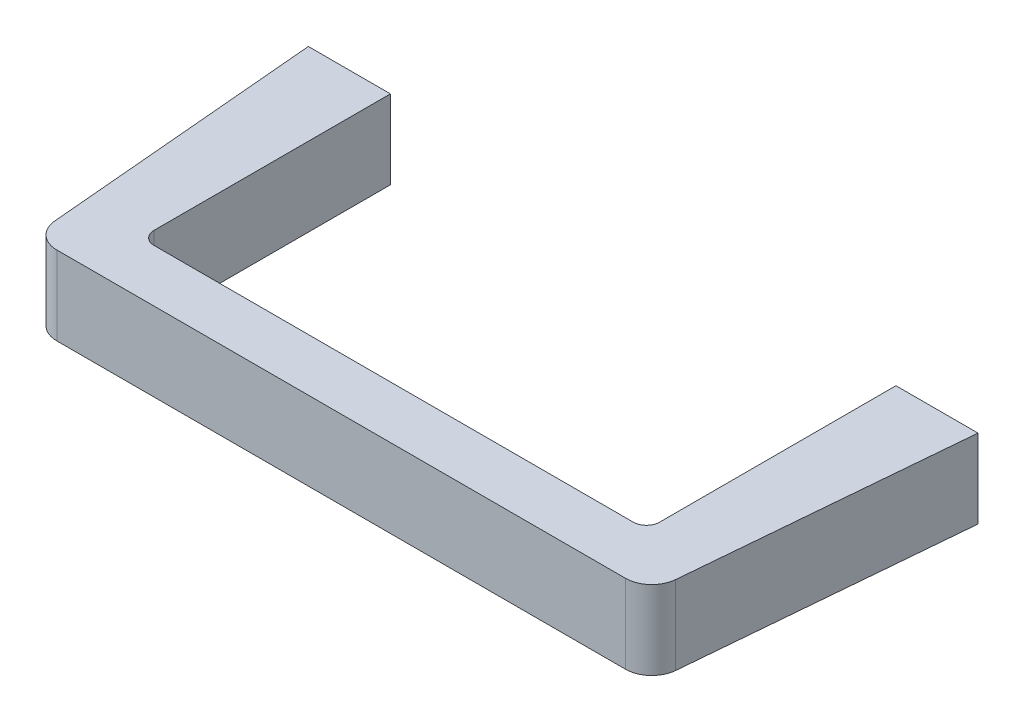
ISO-10303-21;
HEADER;
FILE_DESCRIPTION(('STEP AP214'),'2;1');
FILE_NAME('part.step','',(''),(''),'','','');
FILE_SCHEMA(('AUTOMOTIVE_DESIGN { 1 0 10303 214 1 1 1 1 }'));
ENDSEC;
DATA;
#1=APPLICATION_CONTEXT('core data for automotive mechanical design processes');
#2=APPLICATION_PROTOCOL_DEFINITION('international standard','automotive_design',2000,#1);
#3=PRODUCT_CONTEXT('',#1,'mechanical');
#4=PRODUCT('Part','Part','',(#3));
#5=PRODUCT_RELATED_PRODUCT_CATEGORY('part','',(#4));
#6=PRODUCT_DEFINITION_FORMATION('','',#4);
#7=PRODUCT_DEFINITION_CONTEXT('part definition',#1,'design');
#8=PRODUCT_DEFINITION('design','',#6,#7);
#9=PRODUCT_DEFINITION_SHAPE('','',#8);
#10=(LENGTH_UNIT() NAMED_UNIT(*) SI_UNIT(.MILLI.,.METRE.));
#11=(NAMED_UNIT(*) PLANE_ANGLE_UNIT() SI_UNIT($,.RADIAN.));
#12=(NAMED_UNIT(*) SI_UNIT($,.STERADIAN.) SOLID_ANGLE_UNIT());
#13=UNCERTAINTY_MEASURE_WITH_UNIT(LENGTH_MEASURE(1.E-05),#10,'distance_accuracy_value','');
#14=(GEOMETRIC_REPRESENTATION_CONTEXT(3) GLOBAL_UNCERTAINTY_ASSIGNED_CONTEXT((#13)) GLOBAL_UNIT_ASSIGNED_CONTEXT((#10,
#11,#12)) REPRESENTATION_CONTEXT('',''));
#15=CARTESIAN_POINT('',(0.,0.,0.));
#16=DIRECTION('',(0.,0.,1.));
#17=DIRECTION('',(1.,0.,0.));
#18=AXIS2_PLACEMENT_3D('',#15,#16,#17);
#19=CARTESIAN_POINT('',(5.5,-6.,0.));
#20=DIRECTION('',(0.,0.,-1.));
#21=DIRECTION('',(0.,1.,0.));
#22=AXIS2_PLACEMENT_3D('',#19,#20,#21);
#23=PLANE('',#22);
#24=DIRECTION('',(0.,1.,0.));
#25=VECTOR('',#24,1.);
#26=CARTESIAN_POINT('',(5.5,-6.,0.));
#27=LINE('',#26,#25);
#28=CARTESIAN_POINT('',(5.5,-6.,0.));
#29=VERTEX_POINT('',#28);
#30=CARTESIAN_POINT('',(5.5,6.,0.));
#31=VERTEX_POINT('',#30);
#32=EDGE_CURVE('E199',#29,#31,#27,.T.);
#33=ORIENTED_EDGE('',*,*,#32,.F.);
#34=DIRECTION('',(-1.,0.,0.));
#35=VECTOR('',#34,1.);
#36=CARTESIAN_POINT('',(5.5,-6.,0.));
#37=LINE('',#36,#35);
#38=CARTESIAN_POINT('',(-7.00000000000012,-6.,0.));
#39=VERTEX_POINT('',#38);
#40=EDGE_CURVE('E155',#29,#39,#37,.T.);
#41=ORIENTED_EDGE('',*,*,#40,.T.);
#42=DIRECTION('',(0.,1.,0.));
#43=VECTOR('',#42,1.);
#44=CARTESIAN_POINT('',(-7.00000000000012,-6.,0.));
#45=LINE('',#44,#43);
#46=CARTESIAN_POINT('',(-7.00000000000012,6.,0.));
#47=VERTEX_POINT('',#46);
#48=EDGE_CURVE('E22',#39,#47,#45,.T.);
#49=ORIENTED_EDGE('',*,*,#48,.T.);
#50=DIRECTION('',(-1.,0.,0.));
#51=VECTOR('',#50,1.);
#52=CARTESIAN_POINT('',(5.5,6.,0.));
#53=LINE('',#52,#51);
#54=EDGE_CURVE('E122',#31,#47,#53,.T.);
#55=ORIENTED_EDGE('',*,*,#54,.F.);
#56=EDGE_LOOP('',(#33,#41,#49,#55));
#57=FACE_BOUND('',#56,.T.);
#58=CARTESIAN_POINT('',(0.,0.,0.));
#59=DIRECTION('',(0.,0.,1.));
#60=DIRECTION('',(0.,-1.,0.));
#61=AXIS2_PLACEMENT_3D('',#58,#59,#60);
#62=CIRCLE('',#61,2.5);
#63=CARTESIAN_POINT('',(0.,-2.5,0.));
#64=VERTEX_POINT('',#63);
#65=EDGE_CURVE('E399',#64,#64,#62,.T.);
#66=ORIENTED_EDGE('',*,*,#65,.T.);
#67=EDGE_LOOP('',(#66));
#68=FACE_BOUND('',#67,.T.);
#69=ADVANCED_FACE('F14',(#57,#68),#23,.T.);
#70=CARTESIAN_POINT('',(0.689803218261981,-6.,42.));
#71=DIRECTION('',(0.,1.,0.));
#72=DIRECTION('',(-1.,0.,0.));
#73=AXIS2_PLACEMENT_3D('',#70,#71,#72);
#74=CYLINDRICAL_SURFACE('',#73,4.);
#75=DIRECTION('',(0.,1.,0.));
#76=VECTOR('',#75,1.);
#77=CARTESIAN_POINT('',(-3.29497557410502,-6.,42.3486229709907));
#78=LINE('',#77,#76);
#79=CARTESIAN_POINT('',(-3.29497557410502,-6.,42.3486229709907));
#80=VERTEX_POINT('',#79);
#81=CARTESIAN_POINT('',(-3.29497557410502,6.,42.3486229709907));
#82=VERTEX_POINT('',#81);
#83=EDGE_CURVE('E9',#80,#82,#78,.T.);
#84=ORIENTED_EDGE('',*,*,#83,.F.);
#85=CARTESIAN_POINT('',(0.689803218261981,-6.,42.));
#86=DIRECTION('',(0.,-1.,0.));
#87=DIRECTION('',(1.,0.,0.));
#88=AXIS2_PLACEMENT_3D('',#85,#86,#87);
#89=CIRCLE('',#88,4.);
#90=CARTESIAN_POINT('',(0.689803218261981,-6.,46.));
#91=VERTEX_POINT('',#90);
#92=EDGE_CURVE('E152',#91,#80,#89,.T.);
#93=ORIENTED_EDGE('',*,*,#92,.F.);
#94=DIRECTION('',(0.,1.,0.));
#95=VECTOR('',#94,1.);
#96=CARTESIAN_POINT('',(0.689803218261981,-6.,46.));
#97=LINE('',#96,#95);
#98=CARTESIAN_POINT('',(0.689803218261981,6.,46.));
#99=VERTEX_POINT('',#98);
#100=EDGE_CURVE('E29',#91,#99,#97,.T.);
#101=ORIENTED_EDGE('',*,*,#100,.T.);
#102=CARTESIAN_POINT('',(0.689803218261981,6.,42.));
#103=DIRECTION('',(0.,-1.,0.));
#104=DIRECTION('',(1.,0.,0.));
#105=AXIS2_PLACEMENT_3D('',#102,#103,#104);
#106=CIRCLE('',#105,4.);
#107=EDGE_CURVE('E113',#99,#82,#106,.T.);
#108=ORIENTED_EDGE('',*,*,#107,.T.);
#109=EDGE_LOOP('',(#84,#93,#101,#108));
#110=FACE_BOUND('',#109,.T.);
#111=ADVANCED_FACE('F114',(#110),#74,.T.);
#112=CARTESIAN_POINT('',(-7.00000000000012,-6.,0.));
#113=DIRECTION('',(-0.996194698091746,0.,0.0871557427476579));
#114=DIRECTION('',(-0.0871557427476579,0.,-0.996194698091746));
#115=AXIS2_PLACEMENT_3D('',#112,#113,#114);
#116=PLANE('',#115);
#117=ORIENTED_EDGE('',*,*,#48,.F.);
#118=DIRECTION('',(0.0871557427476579,0.,0.996194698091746));
#119=VECTOR('',#118,1.);
#120=CARTESIAN_POINT('',(-7.00000000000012,-6.,0.));
#121=LINE('',#120,#119);
#122=EDGE_CURVE('E109',#39,#80,#121,.T.);
#123=ORIENTED_EDGE('',*,*,#122,.T.);
#124=ORIENTED_EDGE('',*,*,#83,.T.);
#125=DIRECTION('',(0.0871557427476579,0.,0.996194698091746));
#126=VECTOR('',#125,1.);
#127=CARTESIAN_POINT('',(-7.00000000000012,6.,0.));
#128=LINE('',#127,#126);
#129=EDGE_CURVE('E106',#47,#82,#128,.T.);
#130=ORIENTED_EDGE('',*,*,#129,.F.);
#131=EDGE_LOOP('',(#117,#123,#124,#130));
#132=FACE_BOUND('',#131,.T.);
#133=ADVANCED_FACE('F16',(#132),#116,.T.);
#134=CARTESIAN_POINT('',(5.5,-6.,0.));
#135=DIRECTION('',(-1.,0.,0.));
#136=DIRECTION('',(0.,-1.,0.));
#137=AXIS2_PLACEMENT_3D('',#134,#135,#136);
#138=PLANE('',#137);
#139=DIRECTION('',(0.,1.,0.));
#140=VECTOR('',#139,1.);
#141=CARTESIAN_POINT('',(5.5,-6.,36.));
#142=LINE('',#141,#140);
#143=CARTESIAN_POINT('',(5.5,-6.,36.));
#144=VERTEX_POINT('',#143);
#145=CARTESIAN_POINT('',(5.5,6.,36.));
#146=VERTEX_POINT('',#145);
#147=EDGE_CURVE('E197',#144,#146,#142,.T.);
#148=ORIENTED_EDGE('',*,*,#147,.F.);
#149=DIRECTION('',(0.,0.,1.));
#150=VECTOR('',#149,1.);
#151=CARTESIAN_POINT('',(5.5,-6.,0.));
#152=LINE('',#151,#150);
#153=EDGE_CURVE('E158',#29,#144,#152,.T.);
#154=ORIENTED_EDGE('',*,*,#153,.F.);
#155=ORIENTED_EDGE('',*,*,#32,.T.);
#156=DIRECTION('',(0.,0.,1.));
#157=VECTOR('',#156,1.);
#158=CARTESIAN_POINT('',(5.5,6.,0.));
#159=LINE('',#158,#157);
#160=EDGE_CURVE('E124',#31,#146,#159,.T.);
#161=ORIENTED_EDGE('',*,*,#160,.T.);
#162=EDGE_LOOP('',(#148,#154,#155,#161));
#163=FACE_BOUND('',#162,.T.);
#164=ADVANCED_FACE('F235',(#163),#138,.F.);
#165=CARTESIAN_POINT('',(7.5,-6.,36.));
#166=DIRECTION('',(0.,1.,0.));
#167=DIRECTION('',(-1.,0.,0.));
#168=AXIS2_PLACEMENT_3D('',#165,#166,#167);
#169=CYLINDRICAL_SURFACE('',#168,2.);
#170=DIRECTION('',(0.,1.,0.));
#171=VECTOR('',#170,1.);
#172=CARTESIAN_POINT('',(7.5,-6.,38.));
#173=LINE('',#172,#171);
#174=CARTESIAN_POINT('',(7.5,-6.,38.));
#175=VERTEX_POINT('',#174);
#176=CARTESIAN_POINT('',(7.5,6.,38.));
#177=VERTEX_POINT('',#176);
#178=EDGE_CURVE('E195',#175,#177,#173,.T.);
#179=ORIENTED_EDGE('',*,*,#178,.F.);
#180=CARTESIAN_POINT('',(7.5,-6.,36.));
#181=DIRECTION('',(0.,-1.,0.));
#182=DIRECTION('',(1.,0.,0.));
#183=AXIS2_PLACEMENT_3D('',#180,#181,#182);
#184=CIRCLE('',#183,2.);
#185=EDGE_CURVE('E161',#175,#144,#184,.T.);
#186=ORIENTED_EDGE('',*,*,#185,.T.);
#187=ORIENTED_EDGE('',*,*,#147,.T.);
#188=CARTESIAN_POINT('',(7.5,6.,36.));
#189=DIRECTION('',(0.,-1.,0.));
#190=DIRECTION('',(1.,0.,0.));
#191=AXIS2_PLACEMENT_3D('',#188,#189,#190);
#192=CIRCLE('',#191,2.);
#193=EDGE_CURVE('E130',#177,#146,#192,.T.);
#194=ORIENTED_EDGE('',*,*,#193,.F.);
#195=EDGE_LOOP('',(#179,#186,#187,#194));
#196=FACE_BOUND('',#195,.T.);
#197=ADVANCED_FACE('F233',(#196),#169,.F.);
#198=CARTESIAN_POINT('',(7.5,-6.,38.));
#199=DIRECTION('',(0.,0.,1.));
#200=DIRECTION('',(0.,-1.,0.));
#201=AXIS2_PLACEMENT_3D('',#198,#199,#200);
#202=PLANE('',#201);
#203=DIRECTION('',(0.,1.,0.));
#204=VECTOR('',#203,1.);
#205=CARTESIAN_POINT('',(80.5,-6.,38.));
#206=LINE('',#205,#204);
#207=CARTESIAN_POINT('',(80.5,-6.,38.));
#208=VERTEX_POINT('',#207);
#209=CARTESIAN_POINT('',(80.5,6.,38.));
#210=VERTEX_POINT('',#209);
#211=EDGE_CURVE('E193',#208,#210,#206,.T.);
#212=ORIENTED_EDGE('',*,*,#211,.F.);
#213=DIRECTION('',(1.,0.,0.));
#214=VECTOR('',#213,1.);
#215=CARTESIAN_POINT('',(7.5,-6.,38.));
#216=LINE('',#215,#214);
#217=EDGE_CURVE('E164',#175,#208,#216,.T.);
#218=ORIENTED_EDGE('',*,*,#217,.F.);
#219=ORIENTED_EDGE('',*,*,#178,.T.);
#220=DIRECTION('',(1.,0.,0.));
#221=VECTOR('',#220,1.);
#222=CARTESIAN_POINT('',(7.5,6.,38.));
#223=LINE('',#222,#221);
#224=EDGE_CURVE('E133',#177,#210,#223,.T.);
#225=ORIENTED_EDGE('',*,*,#224,.T.);
#226=EDGE_LOOP('',(#212,#218,#219,#225));
#227=FACE_BOUND('',#226,.T.);
#228=ADVANCED_FACE('F229',(#227),#202,.F.);
#229=CARTESIAN_POINT('',(80.5,-6.,36.));
#230=DIRECTION('',(0.,1.,0.));
#231=DIRECTION('',(-1.,0.,0.));
#232=AXIS2_PLACEMENT_3D('',#229,#230,#231);
#233=CYLINDRICAL_SURFACE('',#232,2.);
#234=DIRECTION('',(0.,1.,0.));
#235=VECTOR('',#234,1.);
#236=CARTESIAN_POINT('',(82.5,-6.,36.));
#237=LINE('',#236,#235);
#238=CARTESIAN_POINT('',(82.5,-6.,36.));
#239=VERTEX_POINT('',#238);
#240=CARTESIAN_POINT('',(82.5,6.,36.));
#241=VERTEX_POINT('',#240);
#242=EDGE_CURVE('E191',#239,#241,#237,.T.);
#243=ORIENTED_EDGE('',*,*,#242,.F.);
#244=CARTESIAN_POINT('',(80.5,-6.,36.));
#245=DIRECTION('',(0.,-1.,0.));
#246=DIRECTION('',(1.,0.,0.));
#247=AXIS2_PLACEMENT_3D('',#244,#245,#246);
#248=CIRCLE('',#247,2.);
#249=EDGE_CURVE('E167',#239,#208,#248,.T.);
#250=ORIENTED_EDGE('',*,*,#249,.T.);
#251=ORIENTED_EDGE('',*,*,#211,.T.);
#252=CARTESIAN_POINT('',(80.5,6.,36.));
#253=DIRECTION('',(0.,-1.,0.));
#254=DIRECTION('',(1.,0.,0.));
#255=AXIS2_PLACEMENT_3D('',#252,#253,#254);
#256=CIRCLE('',#255,2.);
#257=EDGE_CURVE('E136',#241,#210,#256,.T.);
#258=ORIENTED_EDGE('',*,*,#257,.F.);
#259=EDGE_LOOP('',(#243,#250,#251,#258));
#260=FACE_BOUND('',#259,.T.);
#261=ADVANCED_FACE('F225',(#260),#233,.F.);
#262=CARTESIAN_POINT('',(82.5,-6.,0.));
#263=DIRECTION('',(-1.,0.,0.));
#264=DIRECTION('',(0.,-1.,0.));
#265=AXIS2_PLACEMENT_3D('',#262,#263,#264);
#266=PLANE('',#265);
#267=DIRECTION('',(0.,1.,0.));
#268=VECTOR('',#267,1.);
#269=CARTESIAN_POINT('',(82.5,-6.,0.));
#270=LINE('',#269,#268);
#271=CARTESIAN_POINT('',(82.5,-6.,0.));
#272=VERTEX_POINT('',#271);
#273=CARTESIAN_POINT('',(82.5,6.,0.));
#274=VERTEX_POINT('',#273);
#275=EDGE_CURVE('E189',#272,#274,#270,.T.);
#276=ORIENTED_EDGE('',*,*,#275,.F.);
#277=DIRECTION('',(0.,0.,1.));
#278=VECTOR('',#277,1.);
#279=CARTESIAN_POINT('',(82.5,-6.,0.));
#280=LINE('',#279,#278);
#281=EDGE_CURVE('E170',#272,#239,#280,.T.);
#282=ORIENTED_EDGE('',*,*,#281,.T.);
#283=ORIENTED_EDGE('',*,*,#242,.T.);
#284=DIRECTION('',(0.,0.,1.));
#285=VECTOR('',#284,1.);
#286=CARTESIAN_POINT('',(82.5,6.,0.));
#287=LINE('',#286,#285);
#288=EDGE_CURVE('E139',#274,#241,#287,.T.);
#289=ORIENTED_EDGE('',*,*,#288,.F.);
#290=EDGE_LOOP('',(#276,#282,#283,#289));
#291=FACE_BOUND('',#290,.T.);
#292=ADVANCED_FACE('F221',(#291),#266,.T.);
#293=CARTESIAN_POINT('',(95.,-6.,0.));
#294=DIRECTION('',(0.,0.,-1.));
#295=DIRECTION('',(0.,1.,0.));
#296=AXIS2_PLACEMENT_3D('',#293,#294,#295);
#297=PLANE('',#296);
#298=CARTESIAN_POINT('',(88.,0.,0.));
#299=DIRECTION('',(0.,0.,-1.));
#300=DIRECTION('',(0.,1.,0.));
#301=AXIS2_PLACEMENT_3D('',#298,#299,#300);
#302=CIRCLE('',#301,2.5);
#303=CARTESIAN_POINT('',(88.,2.5,0.));
#304=VERTEX_POINT('',#303);
#305=EDGE_CURVE('E398',#304,#304,#302,.T.);
#306=ORIENTED_EDGE('',*,*,#305,.F.);
#307=EDGE_LOOP('',(#306));
#308=FACE_BOUND('',#307,.T.);
#309=DIRECTION('',(0.,1.,0.));
#310=VECTOR('',#309,1.);
#311=CARTESIAN_POINT('',(95.,-6.,0.));
#312=LINE('',#311,#310);
#313=CARTESIAN_POINT('',(95.,-6.,0.));
#314=VERTEX_POINT('',#313);
#315=CARTESIAN_POINT('',(95.,6.,0.));
#316=VERTEX_POINT('',#315);
#317=EDGE_CURVE('E187',#314,#316,#312,.T.);
#318=ORIENTED_EDGE('',*,*,#317,.F.);
#319=DIRECTION('',(-1.,0.,0.));
#320=VECTOR('',#319,1.);
#321=CARTESIAN_POINT('',(95.,-6.,0.));
#322=LINE('',#321,#320);
#323=EDGE_CURVE('E173',#314,#272,#322,.T.);
#324=ORIENTED_EDGE('',*,*,#323,.T.);
#325=ORIENTED_EDGE('',*,*,#275,.T.);
#326=DIRECTION('',(-1.,0.,0.));
#327=VECTOR('',#326,1.);
#328=CARTESIAN_POINT('',(95.,6.,0.));
#329=LINE('',#328,#327);
#330=EDGE_CURVE('E142',#316,#274,#329,.T.);
#331=ORIENTED_EDGE('',*,*,#330,.F.);
#332=EDGE_LOOP('',(#318,#324,#325,#331));
#333=FACE_BOUND('',#332,.T.);
#334=ADVANCED_FACE('F217',(#308,#333),#297,.T.);
#335=CARTESIAN_POINT('',(95.,-6.,0.));
#336=DIRECTION('',(-0.996194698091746,0.,-0.0871557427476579));
#337=DIRECTION('',(0.0871557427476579,0.,-0.996194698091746));
#338=AXIS2_PLACEMENT_3D('',#335,#336,#337);
#339=PLANE('',#338);
#340=DIRECTION('',(0.,1.,0.));
#341=VECTOR('',#340,1.);
#342=CARTESIAN_POINT('',(91.2949755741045,-6.,42.3486229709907));
#343=LINE('',#342,#341);
#344=CARTESIAN_POINT('',(91.2949755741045,-6.,42.3486229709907));
#345=VERTEX_POINT('',#344);
#346=CARTESIAN_POINT('',(91.2949755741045,6.,42.3486229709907));
#347=VERTEX_POINT('',#346);
#348=EDGE_CURVE('E185',#345,#347,#343,.T.);
#349=ORIENTED_EDGE('',*,*,#348,.F.);
#350=DIRECTION('',(-0.0871557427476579,0.,0.996194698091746));
#351=VECTOR('',#350,1.);
#352=CARTESIAN_POINT('',(95.,-6.,0.));
#353=LINE('',#352,#351);
#354=EDGE_CURVE('E176',#314,#345,#353,.T.);
#355=ORIENTED_EDGE('',*,*,#354,.F.);
#356=ORIENTED_EDGE('',*,*,#317,.T.);
#357=DIRECTION('',(-0.0871557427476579,0.,0.996194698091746));
#358=VECTOR('',#357,1.);
#359=CARTESIAN_POINT('',(95.,6.,0.));
#360=LINE('',#359,#358);
#361=EDGE_CURVE('E145',#316,#347,#360,.T.);
#362=ORIENTED_EDGE('',*,*,#361,.T.);
#363=EDGE_LOOP('',(#349,#355,#356,#362));
#364=FACE_BOUND('',#363,.T.);
#365=ADVANCED_FACE('F213',(#364),#339,.F.);
#366=CARTESIAN_POINT('',(87.3101967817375,-6.,42.));
#367=DIRECTION('',(0.,1.,0.));
#368=DIRECTION('',(-1.,0.,0.));
#369=AXIS2_PLACEMENT_3D('',#366,#367,#368);
#370=CYLINDRICAL_SURFACE('',#369,4.);
#371=DIRECTION('',(0.,1.,0.));
#372=VECTOR('',#371,1.);
#373=CARTESIAN_POINT('',(87.3101967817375,-6.,46.));
#374=LINE('',#373,#372);
#375=CARTESIAN_POINT('',(87.3101967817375,-6.,46.));
#376=VERTEX_POINT('',#375);
#377=CARTESIAN_POINT('',(87.3101967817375,6.,46.));
#378=VERTEX_POINT('',#377);
#379=EDGE_CURVE('E37',#376,#378,#374,.T.);
#380=ORIENTED_EDGE('',*,*,#379,.F.);
#381=CARTESIAN_POINT('',(87.3101967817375,-6.,42.));
#382=DIRECTION('',(0.,-1.,0.));
#383=DIRECTION('',(1.,0.,0.));
#384=AXIS2_PLACEMENT_3D('',#381,#382,#383);
#385=CIRCLE('',#384,4.);
#386=EDGE_CURVE('E179',#345,#376,#385,.T.);
#387=ORIENTED_EDGE('',*,*,#386,.F.);
#388=ORIENTED_EDGE('',*,*,#348,.T.);
#389=CARTESIAN_POINT('',(87.3101967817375,6.,42.));
#390=DIRECTION('',(0.,-1.,0.));
#391=DIRECTION('',(1.,0.,0.));
#392=AXIS2_PLACEMENT_3D('',#389,#390,#391);
#393=CIRCLE('',#392,4.);
#394=EDGE_CURVE('E148',#347,#378,#393,.T.);
#395=ORIENTED_EDGE('',*,*,#394,.T.);
#396=EDGE_LOOP('',(#380,#387,#388,#395));
#397=FACE_BOUND('',#396,.T.);
#398=ADVANCED_FACE('F209',(#397),#370,.T.);
#399=CARTESIAN_POINT('',(0.689803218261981,-6.,46.));
#400=DIRECTION('',(0.,0.,1.));
#401=DIRECTION('',(-1.,0.,0.));
#402=AXIS2_PLACEMENT_3D('',#399,#400,#401);
#403=PLANE('',#402);
#404=DIRECTION('',(1.,0.,0.));
#405=VECTOR('',#404,1.);
#406=CARTESIAN_POINT('',(0.689803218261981,-6.,46.));
#407=LINE('',#406,#405);
#408=EDGE_CURVE('E181',#91,#376,#407,.T.);
#409=ORIENTED_EDGE('',*,*,#408,.T.);
#410=ORIENTED_EDGE('',*,*,#379,.T.);
#411=DIRECTION('',(1.,0.,0.));
#412=VECTOR('',#411,1.);
#413=CARTESIAN_POINT('',(0.689803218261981,6.,46.));
#414=LINE('',#413,#412);
#415=EDGE_CURVE('E150',#99,#378,#414,.T.);
#416=ORIENTED_EDGE('',*,*,#415,.F.);
#417=ORIENTED_EDGE('',*,*,#100,.F.);
#418=EDGE_LOOP('',(#409,#410,#416,#417));
#419=FACE_BOUND('',#418,.T.);
#420=ADVANCED_FACE('F207',(#419),#403,.T.);
#421=CARTESIAN_POINT('',(0.689803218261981,-6.,42.));
#422=DIRECTION('',(0.,-1.,0.));
#423=DIRECTION('',(1.,0.,0.));
#424=AXIS2_PLACEMENT_3D('',#421,#422,#423);
#425=PLANE('',#424);
#426=ORIENTED_EDGE('',*,*,#92,.T.);
#427=ORIENTED_EDGE('',*,*,#122,.F.);
#428=ORIENTED_EDGE('',*,*,#40,.F.);
#429=ORIENTED_EDGE('',*,*,#153,.T.);
#430=ORIENTED_EDGE('',*,*,#185,.F.);
#431=ORIENTED_EDGE('',*,*,#217,.T.);
#432=ORIENTED_EDGE('',*,*,#249,.F.);
#433=ORIENTED_EDGE('',*,*,#281,.F.);
#434=ORIENTED_EDGE('',*,*,#323,.F.);
#435=ORIENTED_EDGE('',*,*,#354,.T.);
#436=ORIENTED_EDGE('',*,*,#386,.T.);
#437=ORIENTED_EDGE('',*,*,#408,.F.);
#438=EDGE_LOOP('',(#426,#427,#428,#429,#430,#431,#432,#433,#434,#435,#436,#437));
#439=FACE_BOUND('',#438,.T.);
#440=ADVANCED_FACE('F204',(#439),#425,.T.);
#441=CARTESIAN_POINT('',(0.689803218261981,6.,42.));
#442=DIRECTION('',(0.,-1.,0.));
#443=DIRECTION('',(1.,0.,0.));
#444=AXIS2_PLACEMENT_3D('',#441,#442,#443);
#445=PLANE('',#444);
#446=ORIENTED_EDGE('',*,*,#107,.F.);
#447=ORIENTED_EDGE('',*,*,#415,.T.);
#448=ORIENTED_EDGE('',*,*,#394,.F.);
#449=ORIENTED_EDGE('',*,*,#361,.F.);
#450=ORIENTED_EDGE('',*,*,#330,.T.);
#451=ORIENTED_EDGE('',*,*,#288,.T.);
#452=ORIENTED_EDGE('',*,*,#257,.T.);
#453=ORIENTED_EDGE('',*,*,#224,.F.);
#454=ORIENTED_EDGE('',*,*,#193,.T.);
#455=ORIENTED_EDGE('',*,*,#160,.F.);
#456=ORIENTED_EDGE('',*,*,#54,.T.);
#457=ORIENTED_EDGE('',*,*,#129,.T.);
#458=EDGE_LOOP('',(#446,#447,#448,#449,#450,#451,#452,#453,#454,#455,#456,#457));
#459=FACE_BOUND('',#458,.T.);
#460=ADVANCED_FACE('F119',(#459),#445,.F.);
#461=CARTESIAN_POINT('',(88.,0.,10.));
#462=DIRECTION('',(0.,0.,-1.));
#463=DIRECTION('',(0.,1.,0.));
#464=AXIS2_PLACEMENT_3D('',#461,#462,#463);
#465=CYLINDRICAL_SURFACE('',#464,2.5);
#466=CARTESIAN_POINT('',(88.,0.,10.));
#467=DIRECTION('',(0.,0.,-1.));
#468=DIRECTION('',(0.,1.,0.));
#469=AXIS2_PLACEMENT_3D('',#466,#467,#468);
#470=CIRCLE('',#469,2.5);
#471=CARTESIAN_POINT('',(88.,2.5,10.));
#472=VERTEX_POINT('',#471);
#473=EDGE_CURVE('E117',#472,#472,#470,.T.);
#474=ORIENTED_EDGE('',*,*,#473,.F.);
#475=EDGE_LOOP('',(#474));
#476=FACE_BOUND('',#475,.T.);
#477=ORIENTED_EDGE('',*,*,#305,.T.);
#478=EDGE_LOOP('',(#477));
#479=FACE_BOUND('',#478,.T.);
#480=ADVANCED_FACE('F323',(#476,#479),#465,.F.);
#481=CARTESIAN_POINT('',(88.,0.,10.));
#482=DIRECTION('',(0.,0.,-1.));
#483=DIRECTION('',(0.,1.,0.));
#484=AXIS2_PLACEMENT_3D('',#481,#482,#483);
#485=PLANE('',#484);
#486=ORIENTED_EDGE('',*,*,#473,.T.);
#487=EDGE_LOOP('',(#486));
#488=FACE_BOUND('',#487,.T.);
#489=ADVANCED_FACE('F324',(#488),#485,.T.);
#490=CARTESIAN_POINT('',(0.,0.,10.));
#491=DIRECTION('',(0.,0.,-1.));
#492=DIRECTION('',(0.,1.,0.));
#493=AXIS2_PLACEMENT_3D('',#490,#491,#492);
#494=CYLINDRICAL_SURFACE('',#493,2.5);
#495=CARTESIAN_POINT('',(0.,0.,10.));
#496=DIRECTION('',(0.,0.,1.));
#497=DIRECTION('',(0.,-1.,0.));
#498=AXIS2_PLACEMENT_3D('',#495,#496,#497);
#499=CIRCLE('',#498,2.5);
#500=CARTESIAN_POINT('',(0.,-2.5,10.));
#501=VERTEX_POINT('',#500);
#502=EDGE_CURVE('E397',#501,#501,#499,.T.);
#503=ORIENTED_EDGE('',*,*,#502,.T.);
#504=EDGE_LOOP('',(#503));
#505=FACE_BOUND('',#504,.T.);
#506=ORIENTED_EDGE('',*,*,#65,.F.);
#507=EDGE_LOOP('',(#506));
#508=FACE_BOUND('',#507,.T.);
#509=ADVANCED_FACE('F340',(#505,#508),#494,.F.);
#510=CARTESIAN_POINT('',(0.,0.,10.));
#511=DIRECTION('',(0.,0.,1.));
#512=DIRECTION('',(0.,-1.,0.));
#513=AXIS2_PLACEMENT_3D('',#510,#511,#512);
#514=PLANE('',#513);
#515=ORIENTED_EDGE('',*,*,#502,.F.);
#516=EDGE_LOOP('',(#515));
#517=FACE_BOUND('',#516,.T.);
#518=ADVANCED_FACE('F333',(#517),#514,.F.);
#519=CLOSED_SHELL('',(#69,#111,#133,#164,#197,#228,#261,#292,#334,#365,#398,#420,#440,#460,#480,
#489,#509,#518));
#520=MANIFOLD_SOLID_BREP('B1',#519);
#521=ADVANCED_BREP_SHAPE_REPRESENTATION('',(#18,#520),#14);
#522=SHAPE_DEFINITION_REPRESENTATION(#9,#521);
ENDSEC;
END-ISO-10303-21;
